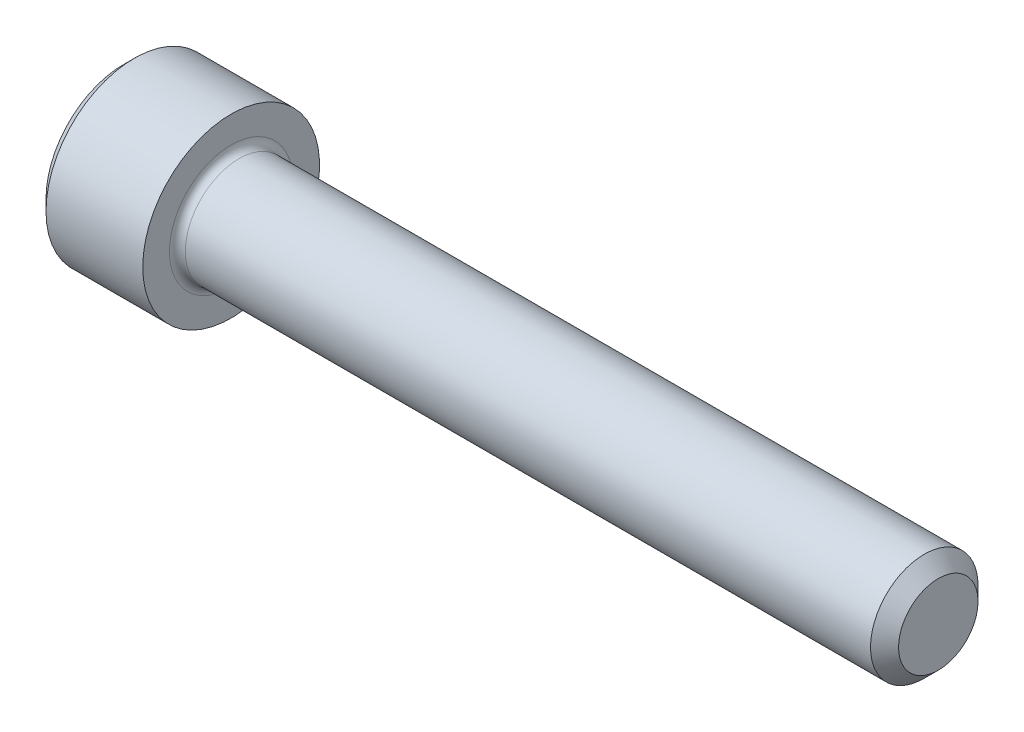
ISO-10303-21;
HEADER;
FILE_DESCRIPTION(('STEP AP214'),'2;1');
FILE_NAME('part.step','',(''),(''),'','','');
FILE_SCHEMA(('AUTOMOTIVE_DESIGN { 1 0 10303 214 1 1 1 1 }'));
ENDSEC;
DATA;
#1=APPLICATION_CONTEXT('core data for automotive mechanical design processes');
#2=APPLICATION_PROTOCOL_DEFINITION('international standard','automotive_design',2000,#1);
#3=PRODUCT_CONTEXT('',#1,'mechanical');
#4=PRODUCT('Part','Part','',(#3));
#5=PRODUCT_RELATED_PRODUCT_CATEGORY('part','',(#4));
#6=PRODUCT_DEFINITION_FORMATION('','',#4);
#7=PRODUCT_DEFINITION_CONTEXT('part definition',#1,'design');
#8=PRODUCT_DEFINITION('design','',#6,#7);
#9=PRODUCT_DEFINITION_SHAPE('','',#8);
#10=(LENGTH_UNIT() NAMED_UNIT(*) SI_UNIT(.MILLI.,.METRE.));
#11=(NAMED_UNIT(*) PLANE_ANGLE_UNIT() SI_UNIT($,.RADIAN.));
#12=(NAMED_UNIT(*) SI_UNIT($,.STERADIAN.) SOLID_ANGLE_UNIT());
#13=UNCERTAINTY_MEASURE_WITH_UNIT(LENGTH_MEASURE(1.E-05),#10,'distance_accuracy_value','');
#14=(GEOMETRIC_REPRESENTATION_CONTEXT(3) GLOBAL_UNCERTAINTY_ASSIGNED_CONTEXT((#13)) GLOBAL_UNIT_ASSIGNED_CONTEXT((#10,
#11,#12)) REPRESENTATION_CONTEXT('',''));
#15=CARTESIAN_POINT('',(0.,0.,0.));
#16=DIRECTION('',(0.,0.,1.));
#17=DIRECTION('',(1.,0.,0.));
#18=AXIS2_PLACEMENT_3D('',#15,#16,#17);
#19=CARTESIAN_POINT('',(0.,0.,0.));
#20=DIRECTION('',(-1.,0.,0.));
#21=DIRECTION('',(0.,0.,1.));
#22=AXIS2_PLACEMENT_3D('',#19,#20,#21);
#23=PLANE('',#22);
#24=DIRECTION('',(0.,-0.499999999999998,0.86602540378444));
#25=VECTOR('',#24,1.);
#26=CARTESIAN_POINT('',(0.,2.2920921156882,0.));
#27=LINE('',#26,#25);
#28=CARTESIAN_POINT('',(0.,2.2920921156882,0.));
#29=VERTEX_POINT('',#28);
#30=CARTESIAN_POINT('',(0.,1.14604605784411,1.98501));
#31=VERTEX_POINT('',#30);
#32=EDGE_CURVE('E264',#29,#31,#27,.T.);
#33=ORIENTED_EDGE('',*,*,#32,.T.);
#34=DIRECTION('',(0.,1.,0.));
#35=VECTOR('',#34,1.);
#36=CARTESIAN_POINT('',(0.,-1.14604605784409,1.98501));
#37=LINE('',#36,#35);
#38=CARTESIAN_POINT('',(0.,-1.14604605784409,1.98501));
#39=VERTEX_POINT('',#38);
#40=EDGE_CURVE('E124',#39,#31,#37,.T.);
#41=ORIENTED_EDGE('',*,*,#40,.F.);
#42=DIRECTION('',(0.,-0.500000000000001,-0.866025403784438));
#43=VECTOR('',#42,1.);
#44=CARTESIAN_POINT('',(0.,-1.14604605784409,1.98501));
#45=LINE('',#44,#43);
#46=CARTESIAN_POINT('',(0.,-2.29209211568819,0.));
#47=VERTEX_POINT('',#46);
#48=EDGE_CURVE('E267',#39,#47,#45,.T.);
#49=ORIENTED_EDGE('',*,*,#48,.T.);
#50=DIRECTION('',(0.,0.499999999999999,-0.86602540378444));
#51=VECTOR('',#50,1.);
#52=CARTESIAN_POINT('',(0.,-2.29209211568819,0.));
#53=LINE('',#52,#51);
#54=CARTESIAN_POINT('',(0.,-1.1460460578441,-1.98501));
#55=VERTEX_POINT('',#54);
#56=EDGE_CURVE('E270',#47,#55,#53,.T.);
#57=ORIENTED_EDGE('',*,*,#56,.T.);
#58=DIRECTION('',(0.,-1.,0.));
#59=VECTOR('',#58,1.);
#60=CARTESIAN_POINT('',(0.,1.1460460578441,-1.98501));
#61=LINE('',#60,#59);
#62=CARTESIAN_POINT('',(0.,1.1460460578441,-1.98501));
#63=VERTEX_POINT('',#62);
#64=EDGE_CURVE('E273',#63,#55,#61,.T.);
#65=ORIENTED_EDGE('',*,*,#64,.F.);
#66=DIRECTION('',(0.,-0.500000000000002,-0.866025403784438));
#67=VECTOR('',#66,1.);
#68=CARTESIAN_POINT('',(0.,2.2920921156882,0.));
#69=LINE('',#68,#67);
#70=EDGE_CURVE('E119',#29,#63,#69,.T.);
#71=ORIENTED_EDGE('',*,*,#70,.F.);
#72=EDGE_LOOP('',(#33,#41,#49,#57,#65,#71));
#73=FACE_BOUND('',#72,.T.);
#74=CARTESIAN_POINT('',(0.,0.,0.));
#75=DIRECTION('',(-1.,0.,0.));
#76=DIRECTION('',(0.,0.,1.));
#77=AXIS2_PLACEMENT_3D('',#74,#75,#76);
#78=CIRCLE('',#77,3.48615);
#79=CARTESIAN_POINT('',(0.,0.,3.48615));
#80=VERTEX_POINT('',#79);
#81=EDGE_CURVE('E148',#80,#80,#78,.T.);
#82=ORIENTED_EDGE('',*,*,#81,.T.);
#83=EDGE_LOOP('',(#82));
#84=FACE_BOUND('',#83,.T.);
#85=ADVANCED_FACE('F32',(#73,#84),#23,.T.);
#86=CARTESIAN_POINT('',(0.,0.,0.));
#87=DIRECTION('',(1.,0.,0.));
#88=DIRECTION('',(0.,0.,-1.));
#89=AXIS2_PLACEMENT_3D('',#86,#87,#88);
#90=CONICAL_SURFACE('',#89,3.48615,0.785398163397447);
#91=CARTESIAN_POINT('',(0.4826,0.,0.));
#92=DIRECTION('',(-1.,0.,0.));
#93=DIRECTION('',(0.,0.,1.));
#94=AXIS2_PLACEMENT_3D('',#91,#92,#93);
#95=CIRCLE('',#94,3.96875);
#96=CARTESIAN_POINT('',(0.4826,0.,3.96875));
#97=VERTEX_POINT('',#96);
#98=EDGE_CURVE('E145',#97,#97,#95,.T.);
#99=ORIENTED_EDGE('',*,*,#98,.T.);
#100=EDGE_LOOP('',(#99));
#101=FACE_BOUND('',#100,.T.);
#102=ORIENTED_EDGE('',*,*,#81,.F.);
#103=EDGE_LOOP('',(#102));
#104=FACE_BOUND('',#103,.T.);
#105=ADVANCED_FACE('F169',(#101,#104),#90,.T.);
#106=CARTESIAN_POINT('',(-31.75,0.,0.));
#107=DIRECTION('',(-1.,0.,0.));
#108=DIRECTION('',(0.,0.,1.));
#109=AXIS2_PLACEMENT_3D('',#106,#107,#108);
#110=CYLINDRICAL_SURFACE('',#109,3.96875);
#111=CARTESIAN_POINT('',(4.826,0.,0.));
#112=DIRECTION('',(-1.,0.,0.));
#113=DIRECTION('',(0.,0.,1.));
#114=AXIS2_PLACEMENT_3D('',#111,#112,#113);
#115=CIRCLE('',#114,3.96875);
#116=CARTESIAN_POINT('',(4.826,0.,3.96875));
#117=VERTEX_POINT('',#116);
#118=EDGE_CURVE('E142',#117,#117,#115,.T.);
#119=ORIENTED_EDGE('',*,*,#118,.T.);
#120=EDGE_LOOP('',(#119));
#121=FACE_BOUND('',#120,.T.);
#122=ORIENTED_EDGE('',*,*,#98,.F.);
#123=EDGE_LOOP('',(#122));
#124=FACE_BOUND('',#123,.T.);
#125=ADVANCED_FACE('F174',(#121,#124),#110,.T.);
#126=CARTESIAN_POINT('',(4.826,3.96875,0.));
#127=DIRECTION('',(1.,0.,0.));
#128=DIRECTION('',(0.,0.,-1.));
#129=AXIS2_PLACEMENT_3D('',#126,#127,#128);
#130=PLANE('',#129);
#131=CARTESIAN_POINT('',(4.826,0.,0.));
#132=DIRECTION('',(1.,0.,0.));
#133=DIRECTION('',(0.,0.,-1.));
#134=AXIS2_PLACEMENT_3D('',#131,#132,#133);
#135=CIRCLE('',#134,2.7686);
#136=CARTESIAN_POINT('',(4.826,0.,-2.7686));
#137=VERTEX_POINT('',#136);
#138=EDGE_CURVE('E40',#137,#137,#135,.F.);
#139=ORIENTED_EDGE('',*,*,#138,.T.);
#140=EDGE_LOOP('',(#139));
#141=FACE_BOUND('',#140,.T.);
#142=ORIENTED_EDGE('',*,*,#118,.F.);
#143=EDGE_LOOP('',(#142));
#144=FACE_BOUND('',#143,.T.);
#145=ADVANCED_FACE('F153',(#141,#144),#130,.T.);
#146=CARTESIAN_POINT('',(-31.75,0.,0.));
#147=DIRECTION('',(-1.,0.,0.));
#148=DIRECTION('',(0.,0.,1.));
#149=AXIS2_PLACEMENT_3D('',#146,#147,#148);
#150=CYLINDRICAL_SURFACE('',#149,2.413);
#151=CARTESIAN_POINT('',(5.1816,0.,0.));
#152=DIRECTION('',(1.,0.,0.));
#153=DIRECTION('',(0.,0.,-1.));
#154=AXIS2_PLACEMENT_3D('',#151,#152,#153);
#155=CIRCLE('',#154,2.413);
#156=CARTESIAN_POINT('',(5.1816,0.,-2.413));
#157=VERTEX_POINT('',#156);
#158=EDGE_CURVE('E11',#157,#157,#155,.T.);
#159=ORIENTED_EDGE('',*,*,#158,.T.);
#160=EDGE_LOOP('',(#159));
#161=FACE_BOUND('',#160,.T.);
#162=CARTESIAN_POINT('',(35.94608,0.,0.));
#163=DIRECTION('',(-1.,0.,0.));
#164=DIRECTION('',(0.,0.,1.));
#165=AXIS2_PLACEMENT_3D('',#162,#163,#164);
#166=CIRCLE('',#165,2.413);
#167=CARTESIAN_POINT('',(35.94608,0.,2.413));
#168=VERTEX_POINT('',#167);
#169=EDGE_CURVE('E139',#168,#168,#166,.T.);
#170=ORIENTED_EDGE('',*,*,#169,.T.);
#171=EDGE_LOOP('',(#170));
#172=FACE_BOUND('',#171,.T.);
#173=ADVANCED_FACE('F184',(#161,#172),#150,.T.);
#174=CARTESIAN_POINT('',(36.576,0.,0.));
#175=DIRECTION('',(-1.,0.,0.));
#176=DIRECTION('',(0.,0.,1.));
#177=AXIS2_PLACEMENT_3D('',#174,#175,#176);
#178=CONICAL_SURFACE('',#177,1.78308,0.785398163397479);
#179=ORIENTED_EDGE('',*,*,#169,.F.);
#180=EDGE_LOOP('',(#179));
#181=FACE_BOUND('',#180,.T.);
#182=CARTESIAN_POINT('',(36.576,0.,0.));
#183=DIRECTION('',(-1.,0.,0.));
#184=DIRECTION('',(0.,0.,1.));
#185=AXIS2_PLACEMENT_3D('',#182,#183,#184);
#186=CIRCLE('',#185,1.78308);
#187=CARTESIAN_POINT('',(36.576,0.,1.78308));
#188=VERTEX_POINT('',#187);
#189=EDGE_CURVE('E135',#188,#188,#186,.T.);
#190=ORIENTED_EDGE('',*,*,#189,.T.);
#191=EDGE_LOOP('',(#190));
#192=FACE_BOUND('',#191,.T.);
#193=ADVANCED_FACE('F164',(#181,#192),#178,.T.);
#194=CARTESIAN_POINT('',(36.576,1.78308,0.));
#195=DIRECTION('',(1.,0.,0.));
#196=DIRECTION('',(0.,0.,-1.));
#197=AXIS2_PLACEMENT_3D('',#194,#195,#196);
#198=PLANE('',#197);
#199=ORIENTED_EDGE('',*,*,#189,.F.);
#200=EDGE_LOOP('',(#199));
#201=FACE_BOUND('',#200,.T.);
#202=ADVANCED_FACE('F157',(#201),#198,.T.);
#203=CARTESIAN_POINT('',(5.1816,0.,0.));
#204=DIRECTION('',(1.,0.,0.));
#205=DIRECTION('',(0.,0.,-1.));
#206=AXIS2_PLACEMENT_3D('',#203,#204,#205);
#207=TOROIDAL_SURFACE('',#206,2.7686,0.3556);
#208=ORIENTED_EDGE('',*,*,#158,.F.);
#209=EDGE_LOOP('',(#208));
#210=FACE_BOUND('',#209,.T.);
#211=ORIENTED_EDGE('',*,*,#138,.F.);
#212=EDGE_LOOP('',(#211));
#213=FACE_BOUND('',#212,.T.);
#214=ADVANCED_FACE('F34',(#210,#213),#207,.F.);
#215=CARTESIAN_POINT('',(2.286,2.2920921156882,0.));
#216=DIRECTION('',(0.,-0.866025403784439,-0.499999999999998));
#217=DIRECTION('',(0.,0.499999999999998,-0.86602540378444));
#218=AXIS2_PLACEMENT_3D('',#215,#216,#217);
#219=PLANE('',#218);
#220=ORIENTED_EDGE('',*,*,#32,.F.);
#221=DIRECTION('',(-1.,0.,0.));
#222=VECTOR('',#221,1.);
#223=CARTESIAN_POINT('',(2.286,2.2920921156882,0.));
#224=LINE('',#223,#222);
#225=CARTESIAN_POINT('',(2.286,2.2920921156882,0.));
#226=VERTEX_POINT('',#225);
#227=EDGE_CURVE('E263',#226,#29,#224,.T.);
#228=ORIENTED_EDGE('',*,*,#227,.F.);
#229=DIRECTION('',(0.,-0.499999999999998,0.86602540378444));
#230=VECTOR('',#229,1.);
#231=CARTESIAN_POINT('',(2.286,2.2920921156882,0.));
#232=LINE('',#231,#230);
#233=CARTESIAN_POINT('',(2.286,1.71906908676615,0.992504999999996));
#234=VERTEX_POINT('',#233);
#235=EDGE_CURVE('E47',#226,#234,#232,.T.);
#236=ORIENTED_EDGE('',*,*,#235,.T.);
#237=CARTESIAN_POINT('',(2.286,1.14604605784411,1.98501));
#238=VERTEX_POINT('',#237);
#239=EDGE_CURVE('E105',#234,#238,#232,.T.);
#240=ORIENTED_EDGE('',*,*,#239,.T.);
#241=DIRECTION('',(-1.,0.,0.));
#242=VECTOR('',#241,1.);
#243=CARTESIAN_POINT('',(2.286,1.14604605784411,1.98501));
#244=LINE('',#243,#242);
#245=EDGE_CURVE('E117',#238,#31,#244,.T.);
#246=ORIENTED_EDGE('',*,*,#245,.T.);
#247=EDGE_LOOP('',(#220,#228,#236,#240,#246));
#248=FACE_BOUND('',#247,.T.);
#249=ADVANCED_FACE('F116',(#248),#219,.T.);
#250=CARTESIAN_POINT('',(2.286,-1.14604605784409,1.98501));
#251=DIRECTION('',(0.,0.,1.));
#252=DIRECTION('',(0.,-1.,0.));
#253=AXIS2_PLACEMENT_3D('',#250,#251,#252);
#254=PLANE('',#253);
#255=ORIENTED_EDGE('',*,*,#40,.T.);
#256=ORIENTED_EDGE('',*,*,#245,.F.);
#257=DIRECTION('',(0.,1.,0.));
#258=VECTOR('',#257,1.);
#259=CARTESIAN_POINT('',(2.286,-1.14604605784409,1.98501));
#260=LINE('',#259,#258);
#261=CARTESIAN_POINT('',(2.286,0.,1.98501));
#262=VERTEX_POINT('',#261);
#263=EDGE_CURVE('E103',#262,#238,#260,.T.);
#264=ORIENTED_EDGE('',*,*,#263,.F.);
#265=CARTESIAN_POINT('',(2.286,-1.14604605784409,1.98501));
#266=VERTEX_POINT('',#265);
#267=EDGE_CURVE('E113',#266,#262,#260,.T.);
#268=ORIENTED_EDGE('',*,*,#267,.F.);
#269=DIRECTION('',(-1.,0.,0.));
#270=VECTOR('',#269,1.);
#271=CARTESIAN_POINT('',(2.286,-1.14604605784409,1.98501));
#272=LINE('',#271,#270);
#273=EDGE_CURVE('E126',#266,#39,#272,.T.);
#274=ORIENTED_EDGE('',*,*,#273,.T.);
#275=EDGE_LOOP('',(#255,#256,#264,#268,#274));
#276=FACE_BOUND('',#275,.T.);
#277=ADVANCED_FACE('F121',(#276),#254,.F.);
#278=CARTESIAN_POINT('',(2.286,-1.14604605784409,1.98501));
#279=DIRECTION('',(0.,0.866025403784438,-0.500000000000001));
#280=DIRECTION('',(0.,0.500000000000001,0.866025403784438));
#281=AXIS2_PLACEMENT_3D('',#278,#279,#280);
#282=PLANE('',#281);
#283=ORIENTED_EDGE('',*,*,#48,.F.);
#284=ORIENTED_EDGE('',*,*,#273,.F.);
#285=DIRECTION('',(0.,-0.500000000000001,-0.866025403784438));
#286=VECTOR('',#285,1.);
#287=CARTESIAN_POINT('',(2.286,-1.14604605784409,1.98501));
#288=LINE('',#287,#286);
#289=CARTESIAN_POINT('',(2.286,-1.71906908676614,0.992505));
#290=VERTEX_POINT('',#289);
#291=EDGE_CURVE('E244',#266,#290,#288,.T.);
#292=ORIENTED_EDGE('',*,*,#291,.T.);
#293=CARTESIAN_POINT('',(2.286,-2.29209211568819,0.));
#294=VERTEX_POINT('',#293);
#295=EDGE_CURVE('E246',#290,#294,#288,.T.);
#296=ORIENTED_EDGE('',*,*,#295,.T.);
#297=DIRECTION('',(-1.,0.,0.));
#298=VECTOR('',#297,1.);
#299=CARTESIAN_POINT('',(2.286,-2.29209211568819,0.));
#300=LINE('',#299,#298);
#301=EDGE_CURVE('E131',#294,#47,#300,.T.);
#302=ORIENTED_EDGE('',*,*,#301,.T.);
#303=EDGE_LOOP('',(#283,#284,#292,#296,#302));
#304=FACE_BOUND('',#303,.T.);
#305=ADVANCED_FACE('F196',(#304),#282,.T.);
#306=CARTESIAN_POINT('',(2.286,-2.29209211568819,0.));
#307=DIRECTION('',(0.,0.866025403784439,0.499999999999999));
#308=DIRECTION('',(0.,-0.499999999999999,0.866025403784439));
#309=AXIS2_PLACEMENT_3D('',#306,#307,#308);
#310=PLANE('',#309);
#311=ORIENTED_EDGE('',*,*,#56,.F.);
#312=ORIENTED_EDGE('',*,*,#301,.F.);
#313=DIRECTION('',(0.,0.499999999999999,-0.86602540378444));
#314=VECTOR('',#313,1.);
#315=CARTESIAN_POINT('',(2.286,-2.29209211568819,0.));
#316=LINE('',#315,#314);
#317=CARTESIAN_POINT('',(2.286,-1.71906908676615,-0.992504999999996));
#318=VERTEX_POINT('',#317);
#319=EDGE_CURVE('E249',#294,#318,#316,.T.);
#320=ORIENTED_EDGE('',*,*,#319,.T.);
#321=CARTESIAN_POINT('',(2.286,-1.1460460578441,-1.98501));
#322=VERTEX_POINT('',#321);
#323=EDGE_CURVE('E253',#318,#322,#316,.T.);
#324=ORIENTED_EDGE('',*,*,#323,.T.);
#325=DIRECTION('',(-1.,0.,0.));
#326=VECTOR('',#325,1.);
#327=CARTESIAN_POINT('',(2.286,-1.1460460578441,-1.98501));
#328=LINE('',#327,#326);
#329=EDGE_CURVE('E282',#322,#55,#328,.T.);
#330=ORIENTED_EDGE('',*,*,#329,.T.);
#331=EDGE_LOOP('',(#311,#312,#320,#324,#330));
#332=FACE_BOUND('',#331,.T.);
#333=ADVANCED_FACE('F199',(#332),#310,.T.);
#334=CARTESIAN_POINT('',(2.286,1.1460460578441,-1.98501));
#335=DIRECTION('',(0.,0.,-1.));
#336=DIRECTION('',(0.,1.,0.));
#337=AXIS2_PLACEMENT_3D('',#334,#335,#336);
#338=PLANE('',#337);
#339=ORIENTED_EDGE('',*,*,#64,.T.);
#340=ORIENTED_EDGE('',*,*,#329,.F.);
#341=DIRECTION('',(0.,-1.,0.));
#342=VECTOR('',#341,1.);
#343=CARTESIAN_POINT('',(2.286,1.1460460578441,-1.98501));
#344=LINE('',#343,#342);
#345=CARTESIAN_POINT('',(2.286,0.,-1.98501));
#346=VERTEX_POINT('',#345);
#347=EDGE_CURVE('E257',#346,#322,#344,.T.);
#348=ORIENTED_EDGE('',*,*,#347,.F.);
#349=CARTESIAN_POINT('',(2.286,1.1460460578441,-1.98501));
#350=VERTEX_POINT('',#349);
#351=EDGE_CURVE('E258',#350,#346,#344,.T.);
#352=ORIENTED_EDGE('',*,*,#351,.F.);
#353=DIRECTION('',(-1.,0.,0.));
#354=VECTOR('',#353,1.);
#355=CARTESIAN_POINT('',(2.286,1.1460460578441,-1.98501));
#356=LINE('',#355,#354);
#357=EDGE_CURVE('E279',#350,#63,#356,.T.);
#358=ORIENTED_EDGE('',*,*,#357,.T.);
#359=EDGE_LOOP('',(#339,#340,#348,#352,#358));
#360=FACE_BOUND('',#359,.T.);
#361=ADVANCED_FACE('F203',(#360),#338,.F.);
#362=CARTESIAN_POINT('',(2.286,2.2920921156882,0.));
#363=DIRECTION('',(0.,0.866025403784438,-0.500000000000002));
#364=DIRECTION('',(0.,0.500000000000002,0.866025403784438));
#365=AXIS2_PLACEMENT_3D('',#362,#363,#364);
#366=PLANE('',#365);
#367=ORIENTED_EDGE('',*,*,#70,.T.);
#368=ORIENTED_EDGE('',*,*,#357,.F.);
#369=DIRECTION('',(0.,-0.500000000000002,-0.866025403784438));
#370=VECTOR('',#369,1.);
#371=CARTESIAN_POINT('',(2.286,2.2920921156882,0.));
#372=LINE('',#371,#370);
#373=CARTESIAN_POINT('',(2.286,1.71906908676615,-0.992505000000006));
#374=VERTEX_POINT('',#373);
#375=EDGE_CURVE('E261',#374,#350,#372,.T.);
#376=ORIENTED_EDGE('',*,*,#375,.F.);
#377=EDGE_CURVE('E235',#226,#374,#372,.T.);
#378=ORIENTED_EDGE('',*,*,#377,.F.);
#379=ORIENTED_EDGE('',*,*,#227,.T.);
#380=EDGE_LOOP('',(#367,#368,#376,#378,#379));
#381=FACE_BOUND('',#380,.T.);
#382=ADVANCED_FACE('F207',(#381),#366,.F.);
#383=CARTESIAN_POINT('',(2.286,1.14604605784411,1.98501));
#384=DIRECTION('',(-1.,0.,0.));
#385=DIRECTION('',(0.,0.,1.));
#386=AXIS2_PLACEMENT_3D('',#383,#384,#385);
#387=PLANE('',#386);
#388=CARTESIAN_POINT('',(2.286,0.,0.));
#389=DIRECTION('',(-1.,0.,0.));
#390=DIRECTION('',(0.,0.,1.));
#391=AXIS2_PLACEMENT_3D('',#388,#389,#390);
#392=CIRCLE('',#391,1.98501);
#393=EDGE_CURVE('E125',#290,#262,#392,.T.);
#394=ORIENTED_EDGE('',*,*,#393,.F.);
#395=ORIENTED_EDGE('',*,*,#291,.F.);
#396=ORIENTED_EDGE('',*,*,#267,.T.);
#397=EDGE_LOOP('',(#394,#395,#396));
#398=FACE_BOUND('',#397,.T.);
#399=ADVANCED_FACE('F211',(#398),#387,.T.);
#400=EDGE_CURVE('E129',#318,#290,#392,.T.);
#401=ORIENTED_EDGE('',*,*,#400,.F.);
#402=ORIENTED_EDGE('',*,*,#319,.F.);
#403=ORIENTED_EDGE('',*,*,#295,.F.);
#404=EDGE_LOOP('',(#401,#402,#403));
#405=FACE_BOUND('',#404,.T.);
#406=ADVANCED_FACE('F214',(#405),#387,.T.);
#407=EDGE_CURVE('E288',#346,#318,#392,.T.);
#408=ORIENTED_EDGE('',*,*,#407,.F.);
#409=ORIENTED_EDGE('',*,*,#347,.T.);
#410=ORIENTED_EDGE('',*,*,#323,.F.);
#411=EDGE_LOOP('',(#408,#409,#410));
#412=FACE_BOUND('',#411,.T.);
#413=ADVANCED_FACE('F219',(#412),#387,.T.);
#414=EDGE_CURVE('E238',#374,#346,#392,.T.);
#415=ORIENTED_EDGE('',*,*,#414,.F.);
#416=ORIENTED_EDGE('',*,*,#375,.T.);
#417=ORIENTED_EDGE('',*,*,#351,.T.);
#418=EDGE_LOOP('',(#415,#416,#417));
#419=FACE_BOUND('',#418,.T.);
#420=ADVANCED_FACE('F226',(#419),#387,.T.);
#421=EDGE_CURVE('E136',#234,#374,#392,.T.);
#422=ORIENTED_EDGE('',*,*,#421,.F.);
#423=ORIENTED_EDGE('',*,*,#235,.F.);
#424=ORIENTED_EDGE('',*,*,#377,.T.);
#425=EDGE_LOOP('',(#422,#423,#424));
#426=FACE_BOUND('',#425,.T.);
#427=ADVANCED_FACE('F222',(#426),#387,.T.);
#428=EDGE_CURVE('E108',#262,#234,#392,.T.);
#429=ORIENTED_EDGE('',*,*,#428,.F.);
#430=ORIENTED_EDGE('',*,*,#263,.T.);
#431=ORIENTED_EDGE('',*,*,#239,.F.);
#432=EDGE_LOOP('',(#429,#430,#431));
#433=FACE_BOUND('',#432,.T.);
#434=ADVANCED_FACE('F104',(#433),#387,.T.);
#435=CARTESIAN_POINT('',(2.286,0.,0.));
#436=DIRECTION('',(-1.,0.,0.));
#437=DIRECTION('',(0.,0.,1.));
#438=AXIS2_PLACEMENT_3D('',#435,#436,#437);
#439=CONICAL_SURFACE('',#438,1.98501,1.04719755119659);
#440=CARTESIAN_POINT('',(3.43204605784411,0.,0.));
#441=VERTEX_POINT('',#440);
#442=VERTEX_LOOP('',#441);
#443=FACE_BOUND('',#442,.T.);
#444=ORIENTED_EDGE('',*,*,#428,.T.);
#445=ORIENTED_EDGE('',*,*,#421,.T.);
#446=ORIENTED_EDGE('',*,*,#414,.T.);
#447=ORIENTED_EDGE('',*,*,#407,.T.);
#448=ORIENTED_EDGE('',*,*,#400,.T.);
#449=ORIENTED_EDGE('',*,*,#393,.T.);
#450=EDGE_LOOP('',(#444,#445,#446,#447,#448,#449));
#451=FACE_BOUND('',#450,.T.);
#452=ADVANCED_FACE('F191',(#443,#451),#439,.F.);
#453=CLOSED_SHELL('',(#85,#105,#125,#145,#173,#193,#202,#214,#249,#277,#305,#333,#361,#382,#399,
#406,#413,#420,#427,#434,#452));
#454=MANIFOLD_SOLID_BREP('B2',#453);
#455=ADVANCED_BREP_SHAPE_REPRESENTATION('',(#18,#454),#14);
#456=SHAPE_DEFINITION_REPRESENTATION(#9,#455);
ENDSEC;
END-ISO-10303-21;
